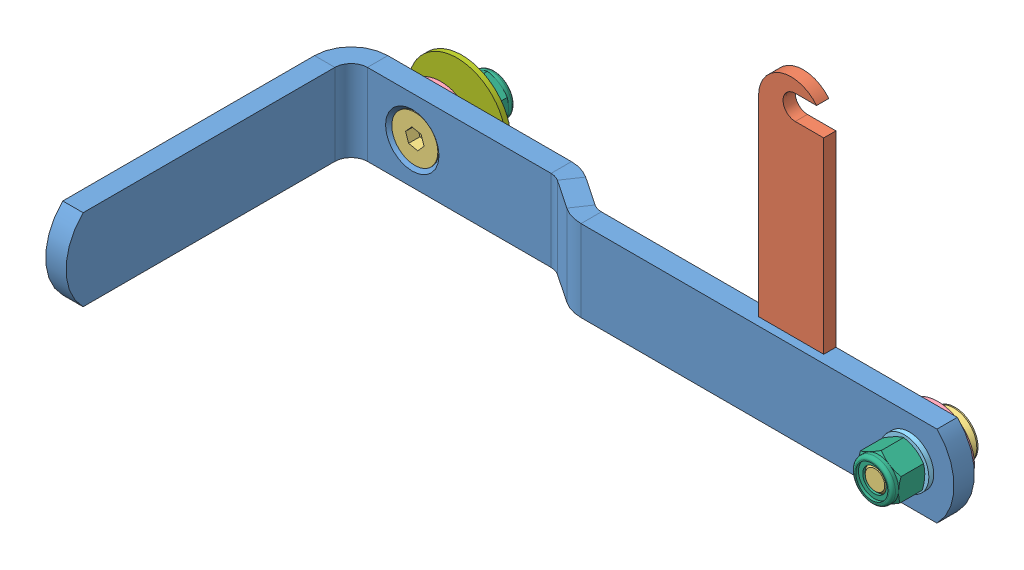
SolidWorks assembly Frein droit assemblé.sldasm, configuration Défaut (file format 7000). Lengths in mm.
Overall size (160 81.84 90.27).
11 component instances, 7 part files, 16 mates.
Components (placement in the parent):
- Patin de frein droit-1: Patin de frein droit.SLDASM [Défaut] at origin size (160 75 75)
  - Patin de frein-1: Patin de frein.SLDPRT [Défaut] at origin size (160 20 75)
  - Attache ressort de frein-1: Attache ressort de frein.SLDPRT [Défaut] at (113 10 -68) size (16 55 3)
- Vis à tête fraisée à six pans creux FHC M6 - 20-1: Vis à tête fraisée à six pans creux FHC M6 - 20.SLDPRT [Réaliste] at (144 0 -71.28) x (0.789762 -0.613414 0) z (0 0 1) size (11.3 11.3 19.65)
- Rondelle plate Nylon Type L-6-1: Rondelle plate Nylon Type L-6.SLDPRT [Défaut] at (144 0 -68) x (0 0 -1) z (-0.029472 -0.999566 0) size (2 18 18)
- Rondelle plate Type Z-6-1: Rondelle plate Type Z-6.SLDPRT [Défaut] at (144 0 -61.8) x (0 0 -1) z (0.94101 -0.338379 0) size (1.2 12 12)
- Ecrou hexagonal autofreiné - M6-1: Ecrou hexagonal autofreiné - M6.SLDPRT [Mise en plan] at (144 0 -61.8) x (0.541104 0.840956 0) z (0 0 -1) size (10 11.55 8)
- Vis à tête fraisée à six pans creux FHC M6 - 20-3: Vis à tête fraisée à six pans creux FHC M6 - 20.SLDPRT [Réaliste] at (15 0 -73.57) x (0.749272 -0.662262 0) z (0 0 -1) size (11.3 11.3 19.65)
- Rondelle plate Nylon Type L-6-3: Rondelle plate Nylon Type L-6.SLDPRT [Défaut] at (15 0 -75) x (0 0 -1) z (0.553873 -0.832601 0) size (2 18 18)
- Rondelle plate Type LL-6-1: Rondelle plate Type LL-6.SLDPRT [Défaut] at (15 0 -81) x (0 0 -1) z (0.789094 -0.614273 0) size (1.2 24 24)
- Ecrou hexagonal autofreiné - M6-3: Ecrou hexagonal autofreiné - M6.SLDPRT [Mise en plan] at (15 0 -82.2) x (-0.546677 -0.837343 0) z (0 0 1) size (10 11.55 8)
Mates (geometry in assembly coordinates):
- Coaxiale2: concentric aligned: cylinder of Patin de frein droit-1/Patin de frein-1 through (144 0 -75) axis (0 0 1) radius 3.05; cylinder of Rondelle plate Nylon Type L-6-1 through (144 0 -68) axis (0 0 1) radius 3.2
- Coïncidente1: coincident anti-aligned: plane of Patin de frein droit-1/Patin de frein-1 through (-1.9055 0 -68) normal (0 0 -1); plane of Rondelle plate Nylon Type L-6-1 through (144.2652 8.9961 -68) normal (0 0 1)
- Coaxiale4: concentric aligned: cylinder of Vis à tête fraisée à six pans creux FHC M6 - 20-1 through (144 0 -71.28) axis (0 0 1) radius 3; cylinder of Rondelle plate Type Z-6-1 through (144 0 -61.8) axis (0 0 1) radius 3.2
- Coïncidente4: coincident anti-aligned: plane of Patin de frein droit-1/Patin de frein-1 through (-1.9055 0 -63) normal (0 0 1); plane of Rondelle plate Type Z-6-1 through (138.3539 2.0303 -63) normal (0 0 -1)
- Coaxiale5: concentric anti-aligned: cylinder of Vis à tête fraisée à six pans creux FHC M6 - 20-1 through (144 0 -71.28) axis (0 0 1) radius 3; cylinder of Ecrou hexagonal autofreiné - M6-1 through (144 0 -46.9147) axis (0 0 -1) radius 2.4
- Coïncidente5: coincident anti-aligned: plane of Rondelle plate Type Z-6-1 through (138.3539 2.0303 -61.8) normal (0 0 1); plane of Ecrou hexagonal autofreiné - M6-1 through (148.5774 -8.8909 -61.8) normal (0 0 -1)
- Coaxiale9: concentric aligned: cylinder of Patin de frein droit-1/Patin de frein-1 through (15 0 0) axis (0 0 -1) radius 3.15; cylinder of Vis à tête fraisée à six pans creux FHC M6 - 20-3 through (15 0 -73.57) axis (0 0 -1) radius 3
- Coïncidente8: coincident aligned: cone of Patin de frein droit-1/Patin de frein-1 through (15 0 -73.42) axis (0 0 -1); cone of Vis à tête fraisée à six pans creux FHC M6 - 20-3 through (15 0 -73.57) axis (0 0 -1)
- Coaxiale10: concentric anti-aligned: cylinder of Vis à tête fraisée à six pans creux FHC M6 - 20-3 through (15 0 -73.57) axis (0 0 -1) radius 3; cylinder of Rondelle plate Nylon Type L-6-3 through (15 0 -75) axis (0 0 1) radius 3.2
- Coïncidente9: coincident anti-aligned: plane of Patin de frein droit-1/Patin de frein-1 through (0 0 -75) normal (0 0 -1); plane of Rondelle plate Nylon Type L-6-3 through (10.0151 7.4934 -75) normal (0 0 1)
- Coaxiale11: concentric anti-aligned: cylinder of Vis à tête fraisée à six pans creux FHC M6 - 20-3 through (15 0 -73.57) axis (0 0 -1) radius 3; cylinder of Rondelle plate Type LL-6-1 through (15 0 -81) axis (0 0 1) radius 3.2
- Distance2: distance = 4 mm anti-aligned: plane of Rondelle plate Type LL-6-1 through (5.5309 7.3713 -81) normal (0 0 1); plane of Rondelle plate Nylon Type L-6-3 through (10.0151 7.4934 -77) normal (0 0 -1)
- Coaxiale12: concentric anti-aligned: cylinder of Vis à tête fraisée à six pans creux FHC M6 - 20-3 through (15 0 -73.57) axis (0 0 -1) radius 3; cylinder of Ecrou hexagonal autofreiné - M6-3 through (15 0 -97.0853) axis (0 0 1) radius 2.4
- Coïncidente10: coincident anti-aligned: plane of Rondelle plate Type LL-6-1 through (5.5309 7.3713 -82.2) normal (0 0 -1); plane of Ecrou hexagonal autofreiné - M6-3 through (24.985 -0.5476 -82.2) normal (0 0 1)
- Distance3: distance = 4.23 mm aligned: plane of Vis à tête fraisée à six pans creux FHC M6 - 20-1 through (148.4622 -3.4658 -74.23) normal (0 0 -1); plane of Rondelle plate Nylon Type L-6-1 through (144.2652 8.9961 -70) normal (0 0 -1)
- Coaxiale13: concentric aligned: cylinder of Vis à tête fraisée à six pans creux FHC M6 - 20-1 through (144 0 -71.28) axis (0 0 1) radius 3; cylinder of Rondelle plate Nylon Type L-6-1 through (144 0 -68) axis (0 0 1) radius 3.2
